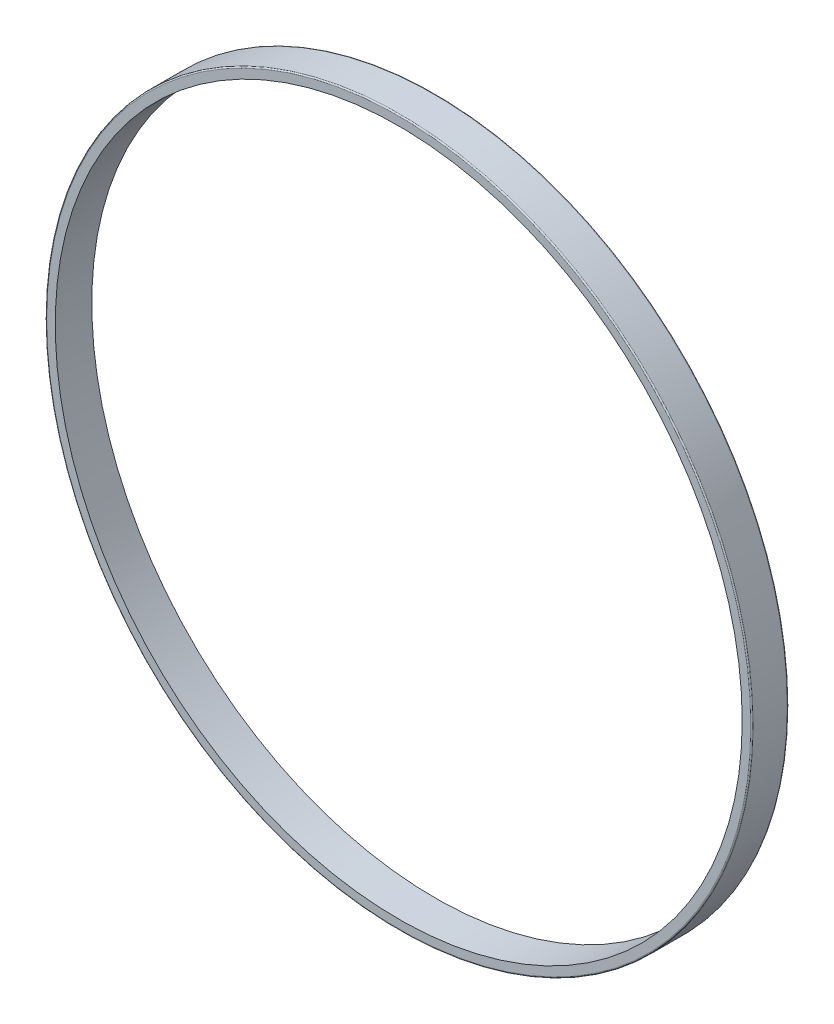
from build123d import *

# Parameters (mm, degrees)
SKETCH_1_R      = 58
SKETCH_1_R_2    = 56.4
EXTRUDE_1_DEPTH = 6
FILLET_1_R      = 0.2


with BuildPart() as part:
    # Sketch 1 → Extrude 1 (new body)
    with BuildSketch(Plane.XY):
        Circle(SKETCH_1_R)
        Circle(SKETCH_1_R_2, mode=Mode.SUBTRACT)
    extrude(amount=EXTRUDE_1_DEPTH)

    # Fillet 1
    fillet_1_edges = [part.edges().sort_by_distance(p)[0] for p in [
        (-58, 0, 0),
        (-58, 0, 6),
    ]]
    fillet(fillet_1_edges, radius=FILLET_1_R)


solid = part.part
